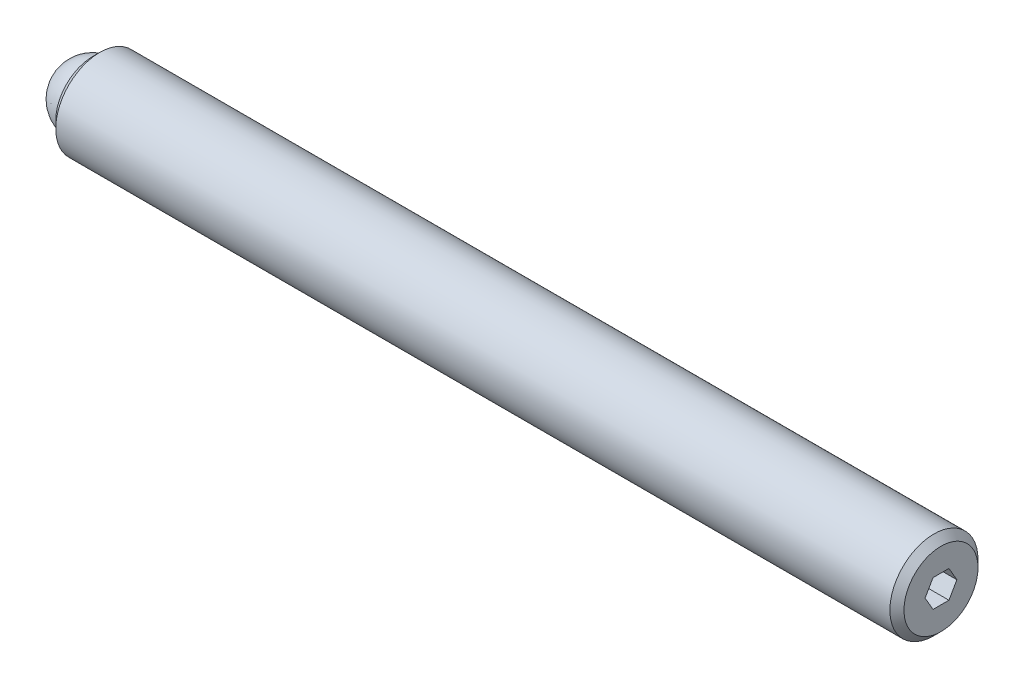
from build123d import *

# Parameters (mm, degrees)
SKETCH2_R           = 3.175
BOSS_EXTRUDE1_DEPTH = 61.11875
CHAMFER1_SIZE       = 0.508
CHAMFER2_SIZE       = 0.508
CUT_EXTRUDE2_DEPTH  = 2.286
SKETCH3_R           = 2.38125
CUT_EXTRUDE3_DEPTH  = 1.984375


with BuildPart() as part:
    # Sketch2 → Boss-Extrude1 (new body)
    with BuildSketch(Plane(origin=(0, 0, 0), x_dir=(0, 0, -1), z_dir=(1, 0, 0))):
        Circle(SKETCH2_R)
    extrude(amount=BOSS_EXTRUDE1_DEPTH)

    # Chamfer1
    chamfer1_edges = [part.edges().sort_by_distance(p)[0] for p in [
        (0, 0, 3.175),
    ]]
    chamfer(chamfer1_edges, length=CHAMFER1_SIZE)

    # Chamfer2
    chamfer2_edges = [part.edges().sort_by_distance(p)[0] for p in [
        (61.11875, 0, 3.175),
    ]]
    chamfer(chamfer2_edges, length=CHAMFER2_SIZE)

    # Sketch4 → Cut-Extrude2 (cut)
    with BuildSketch(Plane(origin=(61.11875, 0, 0), x_dir=(0, 0, -1), z_dir=(1, 0, 0))):
        Polygon((1.14567944, 0), (0.57283972, 0.9921875), (-0.57283972, 0.9921875), (-1.14567944, 0), (-0.57283972, -0.9921875), (0.57283972, -0.9921875), align=None)
    extrude(amount=-CUT_EXTRUDE2_DEPTH, mode=Mode.SUBTRACT)

    # Sketch3 → Cut-Extrude3 (cut)
    with BuildSketch(Plane.ZY):
        Circle(SKETCH3_R)
    extrude(amount=-CUT_EXTRUDE3_DEPTH, mode=Mode.SUBTRACT)


with BuildPart() as body_2:
    # Sketch5 → Revolve1 (revolve)
    with BuildSketch(Plane.ZY):
        with BuildLine():
            Line((0, 0), (0, -2.38125))
            ThreePointArc((0, -2.38125), (-2.38125, 0), (0, 2.38125))
            Line((0, 2.38125), (0, 0))
        make_face()
    revolve(axis=Axis((0, 0, 0), (0, 1, 0)))


solid = Compound([part.part, body_2.part])
